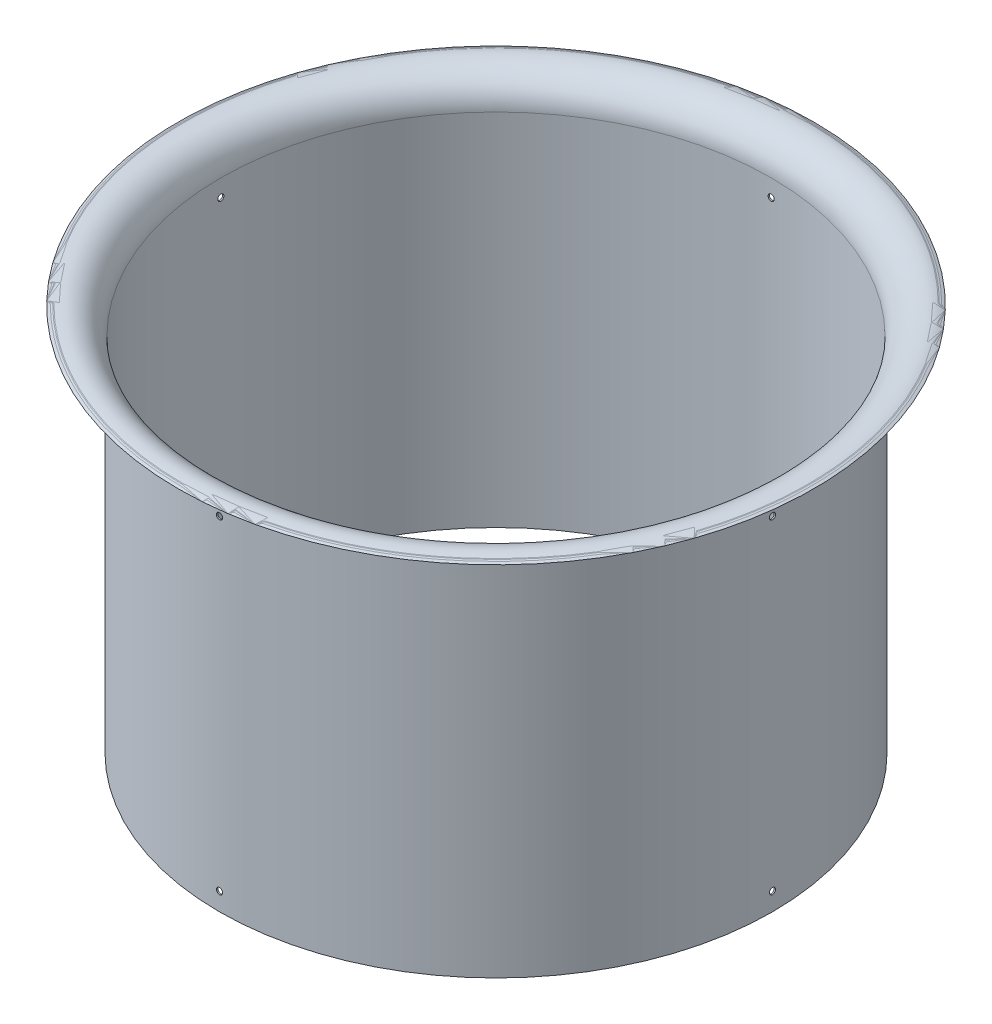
from build123d import *

# Parameters (mm, degrees)
SKETCH8_W                      = 1.63195
SKETCH8_H                      = 167.809131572
F_4_CLEARANCE_HOLE1_AT_2_COUNT = 2
F_4_CLEARANCE_HOLE1_AT_2_PITCH = 171.45
CIRPATTERN1_COUNT              = 4
CIRPATTERN1_COPY_1_SKETCH_W    = 1.63195
CIRPATTERN1_COPY_1_SKETCH_H    = 167.809131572
CIRPATTERN1_COPY_2_SKETCH_W    = 1.63195
CIRPATTERN1_COPY_2_SKETCH_H    = 167.809131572
CIRPATTERN1_COPY_3_SKETCH_W    = 1.63195
CIRPATTERN1_COPY_3_SKETCH_H    = 167.809131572


with BuildPart() as part:
    # Sketch4 → Revolve2 (revolve)
    with BuildSketch(Plane.XY, mode=Mode.PRIVATE) as revolve2_sk:
        with BuildLine():
            Line((-146.05, 0), (-146.05, 190.5))
            ThreePointArc((-146.05, 190.5), (-153.127062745, 203.399781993), (-167.809131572, 204.362095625))
            ThreePointArc((-167.809131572, 204.362095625), (-152.641671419, 203.385402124), (-145.3261, 190.062932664))
            Line((-145.3261, 190.062932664), (-145.3261, 0))
            Line((-145.3261, 0), (-146.05, 0))
        make_face()
    revolve(revolve2_sk.sketch.rotate(Axis((0, 0, 0), (0, 1, 0)), 270), axis=Axis((0, 0, 0), (0, 1, 0)))

    # Sketch8 → 4 Clearance Hole1 (revolve, cut)
    with BuildSketch(Plane(origin=(0, 180.975, 0), x_dir=(0, -1, 0), z_dir=(1, 0, 0))):
        with Locations((0.815975, 83.904565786)):
            Rectangle(SKETCH8_W, SKETCH8_H)
    f_4_clearance_hole1 = revolve(axis=Axis((0, 180.975, 6.35), (0, 0, -1)), mode=Mode.SUBTRACT)

    # 4 Clearance Hole1 at 2: 4 Clearance Hole1 ×2
    with Locations(*[(0, -i * F_4_CLEARANCE_HOLE1_AT_2_PITCH, 0) for i in range(1, F_4_CLEARANCE_HOLE1_AT_2_COUNT)]):
        add(f_4_clearance_hole1, mode=Mode.SUBTRACT)

    # CirPattern1: 4 Clearance Hole1 ×4 about axis
    cirpattern1_axis = Axis((0, 0, 0), (0, -1, 0))
    for i in range(1, CIRPATTERN1_COUNT):
        add(f_4_clearance_hole1.rotate(cirpattern1_axis, i * 360 / CIRPATTERN1_COUNT), mode=Mode.SUBTRACT)

    # CirPattern1 copy 1 sketch → CirPattern1 copy 1 (revolve, cut)
    with BuildSketch(Plane(origin=(0, 9.525, 0), x_dir=(0, -1, 0), z_dir=(0, 0, 1))):
        with Locations((0.815975, 83.904565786)):
            Rectangle(CIRPATTERN1_COPY_1_SKETCH_W, CIRPATTERN1_COPY_1_SKETCH_H)
    revolve(axis=Axis((-6.35, 9.525, 0), (1, 0, 0)), mode=Mode.SUBTRACT)

    # CirPattern1 copy 2 sketch → CirPattern1 copy 2 (revolve, cut)
    with BuildSketch(Plane(origin=(0, 9.525, 0), x_dir=(0, -1, 0), z_dir=(-1, 0, 0))):
        with Locations((0.815975, 83.904565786)):
            Rectangle(CIRPATTERN1_COPY_2_SKETCH_W, CIRPATTERN1_COPY_2_SKETCH_H)
    revolve(axis=Axis((0, 9.525, -6.35), (0, 0, 1)), mode=Mode.SUBTRACT)

    # CirPattern1 copy 3 sketch → CirPattern1 copy 3 (revolve, cut)
    with BuildSketch(Plane(origin=(0, 9.525, 0), x_dir=(0, -1, 0), z_dir=(0, 0, -1))):
        with Locations((0.815975, 83.904565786)):
            Rectangle(CIRPATTERN1_COPY_3_SKETCH_W, CIRPATTERN1_COPY_3_SKETCH_H)
    revolve(axis=Axis((6.35, 9.525, 0), (-1, 0, 0)), mode=Mode.SUBTRACT)


solid = part.part
